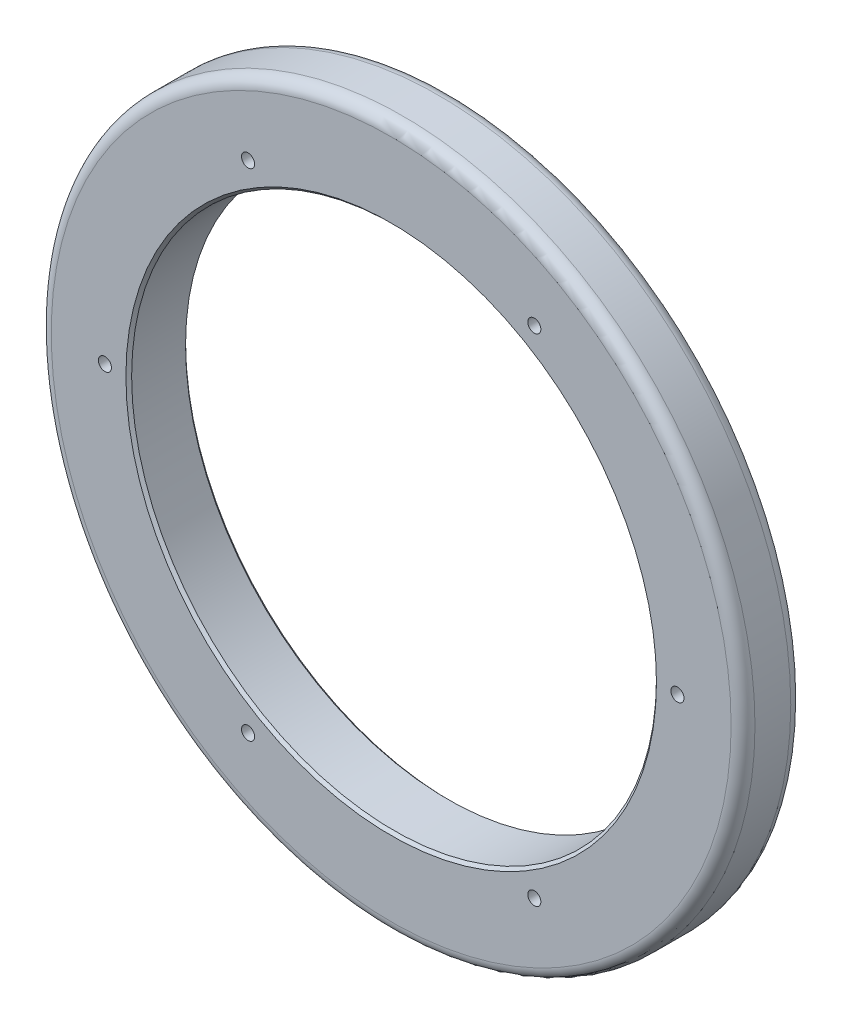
from build123d import *

# Parameters (mm, degrees)
SKETCH1_R          = 93.6625
SKETCH1_R_2        = 69.85
BASE_EXTRUDE_DEPTH = 15.875
FILLET1_R          = 3.175
SKETCH2_R          = 1.7399
CUT_EXTRUDE1_DEPTH = 15.875
CHAMFER1_SIZE      = 0.762


with BuildPart() as part:
    # Sketch1 → Base-Extrude (new body)
    with BuildSketch(Plane.XY):
        with Locations(Location((0, 0, 0), (0, 0, 180))):
            Circle(SKETCH1_R)
        with Locations(Location((0, 0, 0), (0, 0, 180))):
            Circle(SKETCH1_R_2, mode=Mode.SUBTRACT)
    extrude(amount=BASE_EXTRUDE_DEPTH)

    # Fillet1
    fillet1_edges = [part.edges().sort_by_distance(p)[0] for p in [
        (93.6625, 0, 0),
        (93.6625, 0, 15.875),
    ]]
    fillet(fillet1_edges, radius=FILLET1_R)

    # Sketch2 → Cut-Extrude1 (cut)
    with BuildSketch(Plane.XY.offset(15.875)):
        with Locations((-38.1, 65.991135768)):
            Circle(SKETCH2_R)
        with Locations((76.2, 0)):
            Circle(SKETCH2_R)
        with Locations((38.1, 65.991135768)):
            Circle(SKETCH2_R)
        with Locations((38.1, -65.991135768)):
            Circle(SKETCH2_R)
        with Locations((-38.1, -65.991135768)):
            Circle(SKETCH2_R)
        with Locations((-76.2, 0)):
            Circle(SKETCH2_R)
    extrude(amount=-CUT_EXTRUDE1_DEPTH, mode=Mode.SUBTRACT)

    # Chamfer1
    chamfer1_edges = [part.edges().sort_by_distance(p)[0] for p in [
        (69.85, 0, 0),
        (69.85, 0, 15.875),
    ]]
    chamfer(chamfer1_edges, length=CHAMFER1_SIZE)


solid = part.part
